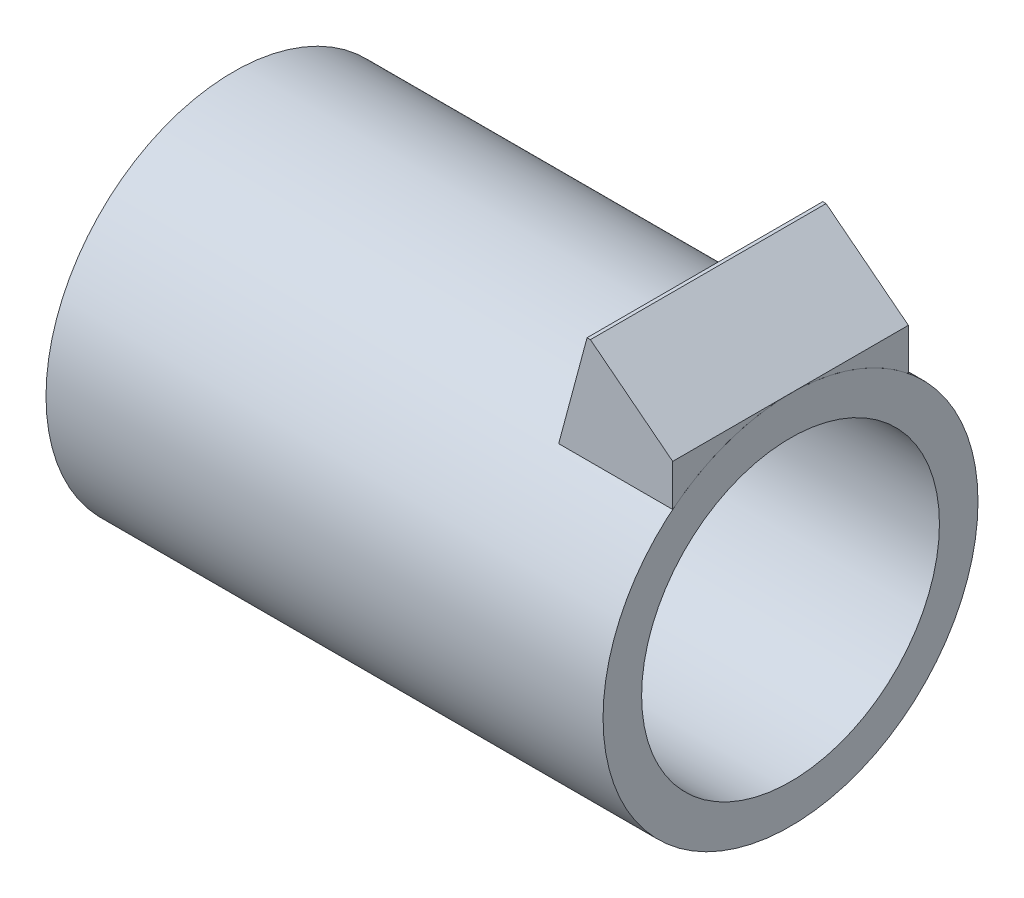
ISO-10303-21;
HEADER;
FILE_DESCRIPTION(('STEP AP214'),'2;1');
FILE_NAME('part.step','',(''),(''),'','','');
FILE_SCHEMA(('AUTOMOTIVE_DESIGN { 1 0 10303 214 1 1 1 1 }'));
ENDSEC;
DATA;
#1=APPLICATION_CONTEXT('core data for automotive mechanical design processes');
#2=APPLICATION_PROTOCOL_DEFINITION('international standard','automotive_design',2000,#1);
#3=PRODUCT_CONTEXT('',#1,'mechanical');
#4=PRODUCT('Part','Part','',(#3));
#5=PRODUCT_RELATED_PRODUCT_CATEGORY('part','',(#4));
#6=PRODUCT_DEFINITION_FORMATION('','',#4);
#7=PRODUCT_DEFINITION_CONTEXT('part definition',#1,'design');
#8=PRODUCT_DEFINITION('design','',#6,#7);
#9=PRODUCT_DEFINITION_SHAPE('','',#8);
#10=(LENGTH_UNIT() NAMED_UNIT(*) SI_UNIT(.MILLI.,.METRE.));
#11=(NAMED_UNIT(*) PLANE_ANGLE_UNIT() SI_UNIT($,.RADIAN.));
#12=(NAMED_UNIT(*) SI_UNIT($,.STERADIAN.) SOLID_ANGLE_UNIT());
#13=UNCERTAINTY_MEASURE_WITH_UNIT(LENGTH_MEASURE(1.E-05),#10,'distance_accuracy_value','');
#14=(GEOMETRIC_REPRESENTATION_CONTEXT(3) GLOBAL_UNCERTAINTY_ASSIGNED_CONTEXT((#13)) GLOBAL_UNIT_ASSIGNED_CONTEXT((#10,
#11,#12)) REPRESENTATION_CONTEXT('',''));
#15=CARTESIAN_POINT('',(0.,0.,0.));
#16=DIRECTION('',(0.,0.,1.));
#17=DIRECTION('',(1.,0.,0.));
#18=AXIS2_PLACEMENT_3D('',#15,#16,#17);
#19=CARTESIAN_POINT('',(26.,0.,0.));
#20=DIRECTION('',(-1.,0.,0.));
#21=DIRECTION('',(0.,0.,1.));
#22=AXIS2_PLACEMENT_3D('',#19,#20,#21);
#23=PLANE('',#22);
#24=CARTESIAN_POINT('',(26.,0.,0.));
#25=DIRECTION('',(-1.,0.,0.));
#26=DIRECTION('',(0.,0.,1.));
#27=AXIS2_PLACEMENT_3D('',#24,#25,#26);
#28=CIRCLE('',#27,8.75000000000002);
#29=CARTESIAN_POINT('',(26.,8.74999999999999,0.));
#30=VERTEX_POINT('',#29);
#31=CARTESIAN_POINT('',(26.,6.8053287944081,-5.5));
#32=VERTEX_POINT('',#31);
#33=EDGE_CURVE('E116',#30,#32,#28,.T.);
#34=ORIENTED_EDGE('',*,*,#33,.T.);
#35=DIRECTION('',(0.,1.,0.));
#36=VECTOR('',#35,1.);
#37=CARTESIAN_POINT('',(26.,11.75,-5.5));
#38=LINE('',#37,#36);
#39=CARTESIAN_POINT('',(26.,8.75,-5.5));
#40=VERTEX_POINT('',#39);
#41=EDGE_CURVE('E52',#32,#40,#38,.T.);
#42=ORIENTED_EDGE('',*,*,#41,.T.);
#43=DIRECTION('',(0.,0.,1.));
#44=VECTOR('',#43,1.);
#45=CARTESIAN_POINT('',(26.,8.75,0.));
#46=LINE('',#45,#44);
#47=EDGE_CURVE('E123',#40,#30,#46,.T.);
#48=ORIENTED_EDGE('',*,*,#47,.T.);
#49=EDGE_LOOP('',(#34,#42,#48));
#50=FACE_BOUND('',#49,.T.);
#51=ADVANCED_FACE('F48',(#50),#23,.F.);
#52=CARTESIAN_POINT('',(26.,6.8053287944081,5.5));
#53=VERTEX_POINT('',#52);
#54=EDGE_CURVE('E119',#53,#30,#28,.T.);
#55=ORIENTED_EDGE('',*,*,#54,.T.);
#56=CARTESIAN_POINT('',(26.,8.75,5.5));
#57=VERTEX_POINT('',#56);
#58=EDGE_CURVE('E124',#30,#57,#46,.T.);
#59=ORIENTED_EDGE('',*,*,#58,.T.);
#60=DIRECTION('',(0.,-1.,0.));
#61=VECTOR('',#60,1.);
#62=CARTESIAN_POINT('',(26.,11.75,5.5));
#63=LINE('',#62,#61);
#64=EDGE_CURVE('E120',#57,#53,#63,.T.);
#65=ORIENTED_EDGE('',*,*,#64,.T.);
#66=EDGE_LOOP('',(#55,#59,#65));
#67=FACE_BOUND('',#66,.T.);
#68=ADVANCED_FACE('F50',(#67),#23,.F.);
#69=CARTESIAN_POINT('',(21.2,0.,0.));
#70=DIRECTION('',(1.,0.,0.));
#71=DIRECTION('',(0.,0.,-1.));
#72=AXIS2_PLACEMENT_3D('',#69,#70,#71);
#73=CYLINDRICAL_SURFACE('',#72,8.75000000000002);
#74=ORIENTED_EDGE('',*,*,#54,.F.);
#75=DIRECTION('',(1.,0.,0.));
#76=VECTOR('',#75,1.);
#77=CARTESIAN_POINT('',(21.2,6.8053287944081,5.5));
#78=LINE('',#77,#76);
#79=CARTESIAN_POINT('',(20.6789269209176,6.8053287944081,5.5));
#80=VERTEX_POINT('',#79);
#81=EDGE_CURVE('E86',#80,#53,#78,.T.);
#82=ORIENTED_EDGE('',*,*,#81,.F.);
#83=CARTESIAN_POINT('',(18.8554445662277,0.,0.));
#84=DIRECTION('',(-0.965925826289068,0.258819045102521,0.));
#85=DIRECTION('',(0.258819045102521,0.965925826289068,0.));
#86=AXIS2_PLACEMENT_3D('',#83,#84,#85);
#87=ELLIPSE('',#86,9.05866657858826,8.75000000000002);
#88=CARTESIAN_POINT('',(20.6789269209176,6.8053287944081,-5.5));
#89=VERTEX_POINT('',#88);
#90=EDGE_CURVE('E103',#80,#89,#87,.T.);
#91=ORIENTED_EDGE('',*,*,#90,.T.);
#92=DIRECTION('',(1.,0.,0.));
#93=VECTOR('',#92,1.);
#94=CARTESIAN_POINT('',(21.2,6.8053287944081,-5.5));
#95=LINE('',#94,#93);
#96=EDGE_CURVE('E112',#89,#32,#95,.T.);
#97=ORIENTED_EDGE('',*,*,#96,.T.);
#98=ORIENTED_EDGE('',*,*,#33,.F.);
#99=EDGE_LOOP('',(#74,#82,#91,#97,#98));
#100=FACE_BOUND('',#99,.T.);
#101=ADVANCED_FACE('F149',(#100),#73,.F.);
#102=CARTESIAN_POINT('',(21.2,8.75,0.));
#103=DIRECTION('',(-0.965925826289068,0.258819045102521,0.));
#104=DIRECTION('',(-0.258819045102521,-0.965925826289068,0.));
#105=AXIS2_PLACEMENT_3D('',#102,#103,#104);
#106=PLANE('',#105);
#107=DIRECTION('',(0.,0.,-1.));
#108=VECTOR('',#107,1.);
#109=CARTESIAN_POINT('',(22.0038475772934,11.75,0.));
#110=LINE('',#109,#108);
#111=CARTESIAN_POINT('',(22.0038475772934,11.75,-5.5));
#112=VERTEX_POINT('',#111);
#113=CARTESIAN_POINT('',(22.0038475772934,11.75,5.5));
#114=VERTEX_POINT('',#113);
#115=EDGE_CURVE('E101',#112,#114,#110,.F.);
#116=ORIENTED_EDGE('',*,*,#115,.F.);
#117=DIRECTION('',(-0.258819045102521,-0.965925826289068,0.));
#118=VECTOR('',#117,1.);
#119=CARTESIAN_POINT('',(21.2,8.75,-5.5));
#120=LINE('',#119,#118);
#121=EDGE_CURVE('E95',#89,#112,#120,.F.);
#122=ORIENTED_EDGE('',*,*,#121,.F.);
#123=ORIENTED_EDGE('',*,*,#90,.F.);
#124=DIRECTION('',(0.258819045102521,0.965925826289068,0.));
#125=VECTOR('',#124,1.);
#126=CARTESIAN_POINT('',(21.2,8.75,5.5));
#127=LINE('',#126,#125);
#128=EDGE_CURVE('E93',#114,#80,#127,.F.);
#129=ORIENTED_EDGE('',*,*,#128,.F.);
#130=EDGE_LOOP('',(#116,#122,#123,#129));
#131=FACE_BOUND('',#130,.T.);
#132=ADVANCED_FACE('F99',(#131),#106,.T.);
#133=CARTESIAN_POINT('',(21.2,11.75,5.5));
#134=DIRECTION('',(0.,0.,1.));
#135=DIRECTION('',(0.,-1.,0.));
#136=AXIS2_PLACEMENT_3D('',#133,#134,#135);
#137=PLANE('',#136);
#138=ORIENTED_EDGE('',*,*,#64,.F.);
#139=DIRECTION('',(0.788010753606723,-0.615661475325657,0.));
#140=VECTOR('',#139,1.);
#141=CARTESIAN_POINT('',(26.,8.75,5.5));
#142=LINE('',#141,#140);
#143=CARTESIAN_POINT('',(22.1601751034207,11.75,5.5));
#144=VERTEX_POINT('',#143);
#145=EDGE_CURVE('E58',#144,#57,#142,.T.);
#146=ORIENTED_EDGE('',*,*,#145,.F.);
#147=DIRECTION('',(1.,0.,0.));
#148=VECTOR('',#147,1.);
#149=CARTESIAN_POINT('',(21.2,11.75,5.5));
#150=LINE('',#149,#148);
#151=EDGE_CURVE('E67',#114,#144,#150,.T.);
#152=ORIENTED_EDGE('',*,*,#151,.F.);
#153=ORIENTED_EDGE('',*,*,#128,.T.);
#154=ORIENTED_EDGE('',*,*,#81,.T.);
#155=EDGE_LOOP('',(#138,#146,#152,#153,#154));
#156=FACE_BOUND('',#155,.T.);
#157=ADVANCED_FACE('F92',(#156),#137,.T.);
#158=CARTESIAN_POINT('',(21.2,11.75,5.5));
#159=DIRECTION('',(0.,1.,0.));
#160=DIRECTION('',(0.,0.,1.));
#161=AXIS2_PLACEMENT_3D('',#158,#159,#160);
#162=PLANE('',#161);
#163=DIRECTION('',(0.,0.,1.));
#164=VECTOR('',#163,1.);
#165=CARTESIAN_POINT('',(22.1601751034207,11.75,0.));
#166=LINE('',#165,#164);
#167=CARTESIAN_POINT('',(22.1601751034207,11.75,-5.5));
#168=VERTEX_POINT('',#167);
#169=EDGE_CURVE('E13',#168,#144,#166,.T.);
#170=ORIENTED_EDGE('',*,*,#169,.F.);
#171=DIRECTION('',(1.,0.,0.));
#172=VECTOR('',#171,1.);
#173=CARTESIAN_POINT('',(21.2,11.75,-5.5));
#174=LINE('',#173,#172);
#175=EDGE_CURVE('E107',#112,#168,#174,.T.);
#176=ORIENTED_EDGE('',*,*,#175,.F.);
#177=ORIENTED_EDGE('',*,*,#115,.T.);
#178=ORIENTED_EDGE('',*,*,#151,.T.);
#179=EDGE_LOOP('',(#170,#176,#177,#178));
#180=FACE_BOUND('',#179,.T.);
#181=ADVANCED_FACE('F105',(#180),#162,.T.);
#182=CARTESIAN_POINT('',(21.2,11.75,-5.5));
#183=DIRECTION('',(0.,0.,-1.));
#184=DIRECTION('',(-1.,0.,0.));
#185=AXIS2_PLACEMENT_3D('',#182,#183,#184);
#186=PLANE('',#185);
#187=ORIENTED_EDGE('',*,*,#41,.F.);
#188=ORIENTED_EDGE('',*,*,#96,.F.);
#189=ORIENTED_EDGE('',*,*,#121,.T.);
#190=ORIENTED_EDGE('',*,*,#175,.T.);
#191=DIRECTION('',(-0.788010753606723,0.615661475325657,0.));
#192=VECTOR('',#191,1.);
#193=CARTESIAN_POINT('',(26.,8.75,-5.5));
#194=LINE('',#193,#192);
#195=EDGE_CURVE('E108',#40,#168,#194,.T.);
#196=ORIENTED_EDGE('',*,*,#195,.F.);
#197=EDGE_LOOP('',(#187,#188,#189,#190,#196));
#198=FACE_BOUND('',#197,.T.);
#199=ADVANCED_FACE('F146',(#198),#186,.T.);
#200=CARTESIAN_POINT('',(26.,8.75,0.));
#201=DIRECTION('',(0.615661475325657,0.788010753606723,0.));
#202=DIRECTION('',(-0.788010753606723,0.615661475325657,0.));
#203=AXIS2_PLACEMENT_3D('',#200,#201,#202);
#204=PLANE('',#203);
#205=ORIENTED_EDGE('',*,*,#47,.F.);
#206=ORIENTED_EDGE('',*,*,#195,.T.);
#207=ORIENTED_EDGE('',*,*,#169,.T.);
#208=ORIENTED_EDGE('',*,*,#145,.T.);
#209=ORIENTED_EDGE('',*,*,#58,.F.);
#210=EDGE_LOOP('',(#205,#206,#207,#208,#209));
#211=FACE_BOUND('',#210,.T.);
#212=ADVANCED_FACE('F132',(#211),#204,.T.);
#213=CLOSED_SHELL('',(#51,#68,#101,#132,#157,#181,#199,#212));
#214=MANIFOLD_SOLID_BREP('B2',#213);
#215=CARTESIAN_POINT('',(15.9536653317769,0.,0.));
#216=DIRECTION('',(1.,0.,0.));
#217=DIRECTION('',(0.,0.,-1.));
#218=AXIS2_PLACEMENT_3D('',#215,#216,#217);
#219=CYLINDRICAL_SURFACE('',#218,8.75);
#220=CARTESIAN_POINT('',(0.,0.,0.));
#221=DIRECTION('',(1.,0.,0.));
#222=DIRECTION('',(0.,0.,-1.));
#223=AXIS2_PLACEMENT_3D('',#220,#221,#222);
#224=CIRCLE('',#223,8.75);
#225=CARTESIAN_POINT('',(0.,0.,-8.75));
#226=VERTEX_POINT('',#225);
#227=EDGE_CURVE('E250',#226,#226,#224,.T.);
#228=ORIENTED_EDGE('',*,*,#227,.T.);
#229=EDGE_LOOP('',(#228));
#230=FACE_BOUND('',#229,.T.);
#231=CARTESIAN_POINT('',(26.,0.,0.));
#232=DIRECTION('',(1.,0.,0.));
#233=DIRECTION('',(0.,0.,-1.));
#234=AXIS2_PLACEMENT_3D('',#231,#232,#233);
#235=CIRCLE('',#234,8.75);
#236=CARTESIAN_POINT('',(26.,0.,-8.75));
#237=VERTEX_POINT('',#236);
#238=EDGE_CURVE('E47',#237,#237,#235,.T.);
#239=ORIENTED_EDGE('',*,*,#238,.F.);
#240=EDGE_LOOP('',(#239));
#241=FACE_BOUND('',#240,.T.);
#242=ADVANCED_FACE('F215',(#230,#241),#219,.T.);
#243=CARTESIAN_POINT('',(26.,8.75,0.));
#244=DIRECTION('',(1.,0.,0.));
#245=DIRECTION('',(0.,0.,-1.));
#246=AXIS2_PLACEMENT_3D('',#243,#244,#245);
#247=PLANE('',#246);
#248=ORIENTED_EDGE('',*,*,#238,.T.);
#249=EDGE_LOOP('',(#248));
#250=FACE_BOUND('',#249,.T.);
#251=CARTESIAN_POINT('',(26.,0.,0.));
#252=DIRECTION('',(1.,0.,0.));
#253=DIRECTION('',(0.,0.,-1.));
#254=AXIS2_PLACEMENT_3D('',#251,#252,#253);
#255=CIRCLE('',#254,6.95);
#256=CARTESIAN_POINT('',(26.,0.,-6.95));
#257=VERTEX_POINT('',#256);
#258=EDGE_CURVE('E222',#257,#257,#255,.T.);
#259=ORIENTED_EDGE('',*,*,#258,.F.);
#260=EDGE_LOOP('',(#259));
#261=FACE_BOUND('',#260,.T.);
#262=ADVANCED_FACE('F269',(#250,#261),#247,.T.);
#263=CARTESIAN_POINT('',(15.9536653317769,0.,0.));
#264=DIRECTION('',(1.,0.,0.));
#265=DIRECTION('',(0.,0.,-1.));
#266=AXIS2_PLACEMENT_3D('',#263,#264,#265);
#267=CYLINDRICAL_SURFACE('',#266,6.95);
#268=ORIENTED_EDGE('',*,*,#258,.T.);
#269=EDGE_LOOP('',(#268));
#270=FACE_BOUND('',#269,.T.);
#271=CARTESIAN_POINT('',(1.6,0.,0.));
#272=DIRECTION('',(1.,0.,0.));
#273=DIRECTION('',(0.,0.,-1.));
#274=AXIS2_PLACEMENT_3D('',#271,#272,#273);
#275=CIRCLE('',#274,6.95);
#276=CARTESIAN_POINT('',(1.6,0.,-6.95));
#277=VERTEX_POINT('',#276);
#278=EDGE_CURVE('E227',#277,#277,#275,.T.);
#279=ORIENTED_EDGE('',*,*,#278,.F.);
#280=EDGE_LOOP('',(#279));
#281=FACE_BOUND('',#280,.T.);
#282=ADVANCED_FACE('F273',(#270,#281),#267,.F.);
#283=CARTESIAN_POINT('',(1.6,6.95,0.));
#284=DIRECTION('',(1.,0.,0.));
#285=DIRECTION('',(0.,0.,-1.));
#286=AXIS2_PLACEMENT_3D('',#283,#284,#285);
#287=PLANE('',#286);
#288=ORIENTED_EDGE('',*,*,#278,.T.);
#289=EDGE_LOOP('',(#288));
#290=FACE_BOUND('',#289,.T.);
#291=ADVANCED_FACE('F277',(#290),#287,.T.);
#292=CARTESIAN_POINT('',(-3.8,0.,0.));
#293=DIRECTION('',(-1.,0.,0.));
#294=DIRECTION('',(0.,0.,1.));
#295=AXIS2_PLACEMENT_3D('',#292,#293,#294);
#296=PLANE('',#295);
#297=CARTESIAN_POINT('',(-3.8,0.,0.));
#298=DIRECTION('',(1.,0.,0.));
#299=DIRECTION('',(0.,0.,-1.));
#300=AXIS2_PLACEMENT_3D('',#297,#298,#299);
#301=CIRCLE('',#300,3.25);
#302=CARTESIAN_POINT('',(-3.8,0.,-3.25));
#303=VERTEX_POINT('',#302);
#304=EDGE_CURVE('E232',#303,#303,#301,.T.);
#305=ORIENTED_EDGE('',*,*,#304,.F.);
#306=EDGE_LOOP('',(#305));
#307=FACE_BOUND('',#306,.T.);
#308=ADVANCED_FACE('F283',(#307),#296,.T.);
#309=CARTESIAN_POINT('',(-1.9,0.,0.));
#310=DIRECTION('',(1.,0.,0.));
#311=DIRECTION('',(0.,0.,-1.));
#312=AXIS2_PLACEMENT_3D('',#309,#310,#311);
#313=CONICAL_SURFACE('',#312,4.6,0.617755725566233);
#314=ORIENTED_EDGE('',*,*,#304,.T.);
#315=EDGE_LOOP('',(#314));
#316=FACE_BOUND('',#315,.T.);
#317=CARTESIAN_POINT('',(-1.9,0.,0.));
#318=DIRECTION('',(1.,0.,0.));
#319=DIRECTION('',(0.,0.,-1.));
#320=AXIS2_PLACEMENT_3D('',#317,#318,#319);
#321=CIRCLE('',#320,4.6);
#322=CARTESIAN_POINT('',(-1.9,0.,-4.6));
#323=VERTEX_POINT('',#322);
#324=EDGE_CURVE('E238',#323,#323,#321,.T.);
#325=ORIENTED_EDGE('',*,*,#324,.F.);
#326=EDGE_LOOP('',(#325));
#327=FACE_BOUND('',#326,.T.);
#328=ADVANCED_FACE('F287',(#316,#327),#313,.T.);
#329=CARTESIAN_POINT('',(-1.9,2.9,0.));
#330=DIRECTION('',(1.,0.,0.));
#331=DIRECTION('',(0.,0.,-1.));
#332=AXIS2_PLACEMENT_3D('',#329,#330,#331);
#333=PLANE('',#332);
#334=ORIENTED_EDGE('',*,*,#324,.T.);
#335=EDGE_LOOP('',(#334));
#336=FACE_BOUND('',#335,.T.);
#337=CARTESIAN_POINT('',(-1.9,0.,0.));
#338=DIRECTION('',(1.,0.,0.));
#339=DIRECTION('',(0.,0.,-1.));
#340=AXIS2_PLACEMENT_3D('',#337,#338,#339);
#341=CIRCLE('',#340,2.9);
#342=CARTESIAN_POINT('',(-1.9,0.,-2.9));
#343=VERTEX_POINT('',#342);
#344=EDGE_CURVE('E242',#343,#343,#341,.T.);
#345=ORIENTED_EDGE('',*,*,#344,.F.);
#346=EDGE_LOOP('',(#345));
#347=FACE_BOUND('',#346,.T.);
#348=ADVANCED_FACE('F265',(#336,#347),#333,.T.);
#349=CARTESIAN_POINT('',(15.9536653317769,0.,0.));
#350=DIRECTION('',(1.,0.,0.));
#351=DIRECTION('',(0.,0.,-1.));
#352=AXIS2_PLACEMENT_3D('',#349,#350,#351);
#353=CYLINDRICAL_SURFACE('',#352,2.9);
#354=ORIENTED_EDGE('',*,*,#344,.T.);
#355=EDGE_LOOP('',(#354));
#356=FACE_BOUND('',#355,.T.);
#357=CARTESIAN_POINT('',(0.,0.,0.));
#358=DIRECTION('',(1.,0.,0.));
#359=DIRECTION('',(0.,0.,-1.));
#360=AXIS2_PLACEMENT_3D('',#357,#358,#359);
#361=CIRCLE('',#360,2.9);
#362=CARTESIAN_POINT('',(0.,0.,-2.9));
#363=VERTEX_POINT('',#362);
#364=EDGE_CURVE('E246',#363,#363,#361,.T.);
#365=ORIENTED_EDGE('',*,*,#364,.F.);
#366=EDGE_LOOP('',(#365));
#367=FACE_BOUND('',#366,.T.);
#368=ADVANCED_FACE('F259',(#356,#367),#353,.T.);
#369=CARTESIAN_POINT('',(0.,2.9,0.));
#370=DIRECTION('',(-1.,0.,0.));
#371=DIRECTION('',(0.,0.,1.));
#372=AXIS2_PLACEMENT_3D('',#369,#370,#371);
#373=PLANE('',#372);
#374=ORIENTED_EDGE('',*,*,#364,.T.);
#375=EDGE_LOOP('',(#374));
#376=FACE_BOUND('',#375,.T.);
#377=ORIENTED_EDGE('',*,*,#227,.F.);
#378=EDGE_LOOP('',(#377));
#379=FACE_BOUND('',#378,.T.);
#380=ADVANCED_FACE('F257',(#376,#379),#373,.T.);
#381=CLOSED_SHELL('',(#242,#262,#282,#291,#308,#328,#348,#368,#380));
#382=MANIFOLD_SOLID_BREP('B7',#381);
#383=ADVANCED_BREP_SHAPE_REPRESENTATION('',(#18,#214,#382),#14);
#384=SHAPE_DEFINITION_REPRESENTATION(#9,#383);
ENDSEC;
END-ISO-10303-21;
